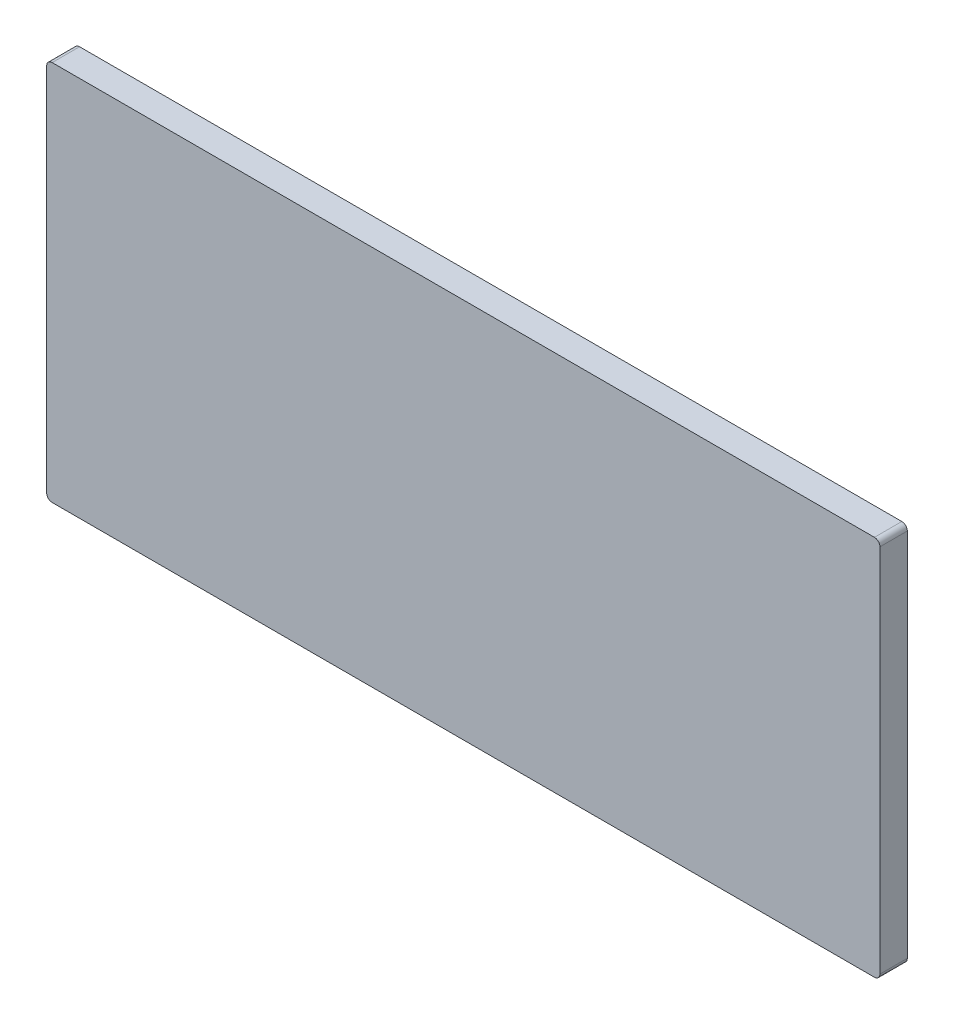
from build123d import *

# Parameters (mm, degrees)
BOSS_EXTRU_1_DEPTH = 10


with BuildPart() as part:
    # Esquisse1 → Boss.-Extru.1 (new body)
    with BuildSketch(Plane.XY):
        with BuildLine():
            Line((-27.859667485, 108.429388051), (272.140332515, 108.429388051))
            ThreePointArc((272.140332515, 108.429388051), (273.554546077, 107.843601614), (274.140332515, 106.429388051))
            Line((274.140332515, 106.429388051), (274.140332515, -28.570611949))
            ThreePointArc((274.140332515, -28.570611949), (273.554546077, -29.984825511), (272.140332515, -30.570611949))
            Line((272.140332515, -30.570611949), (-27.859667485, -30.570611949))
            ThreePointArc((-27.859667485, -30.570611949), (-29.273881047, -29.984825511), (-29.859667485, -28.570611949))
            Line((-29.859667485, -28.570611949), (-29.859667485, 106.429388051))
            ThreePointArc((-29.859667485, 106.429388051), (-29.273881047, 107.843601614), (-27.859667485, 108.429388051))
        make_face()
    extrude(amount=BOSS_EXTRU_1_DEPTH)


solid = part.part
